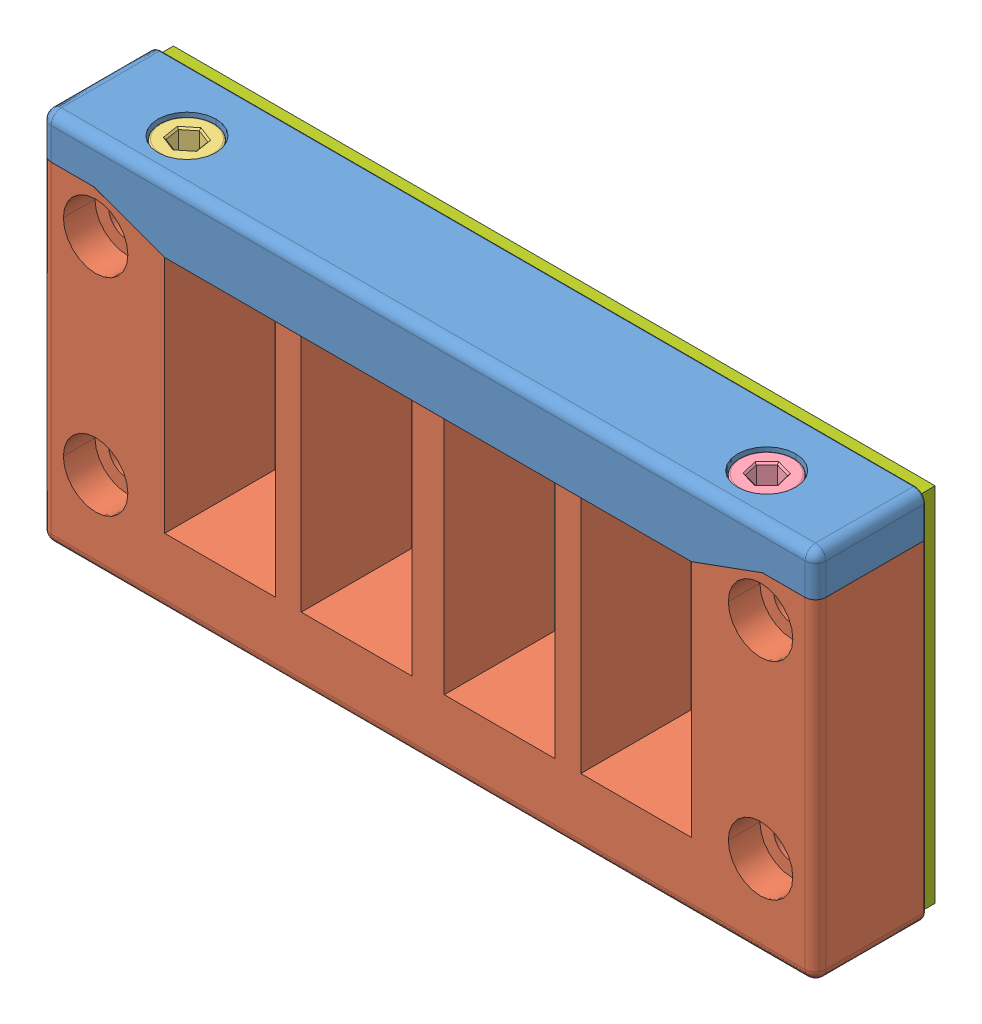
SolidWorks assembly 54168_200.SLDASM, configuration Default (file format 8000). Lengths in mm.
Overall size (120 58 19.55).
7 component instances, 7 part files, 0 mates.
Components (placement in the parent):
- 54168_200_01-1: 54168_200_01.SLDPRT [Default] at origin size (120 10.5 17.05)
- 54168_200_02-1: 54168_200_02.SLDPRT [Default] at origin size (120 51.5 17.05)
- 54168_200_03-1: 54168_200_03.SLDPRT [Default] at origin size (8.5 57 8.5)
- 54168_200_04-1: 54168_200_04.SLDPRT [Default] at origin size (8.5 57 8.5)
- 54168_200_05-1: 54168_200_05.SLDPRT [Default] at origin size (9.25 4.7 8.01)
- 54168_200_06-1: 54168_200_06.SLDPRT [Default] at origin size (9.25 4.7 8.01)
- 54168_200_07-1: 54168_200_07.SLDPRT [Default] at origin size (118 56 2.5)
